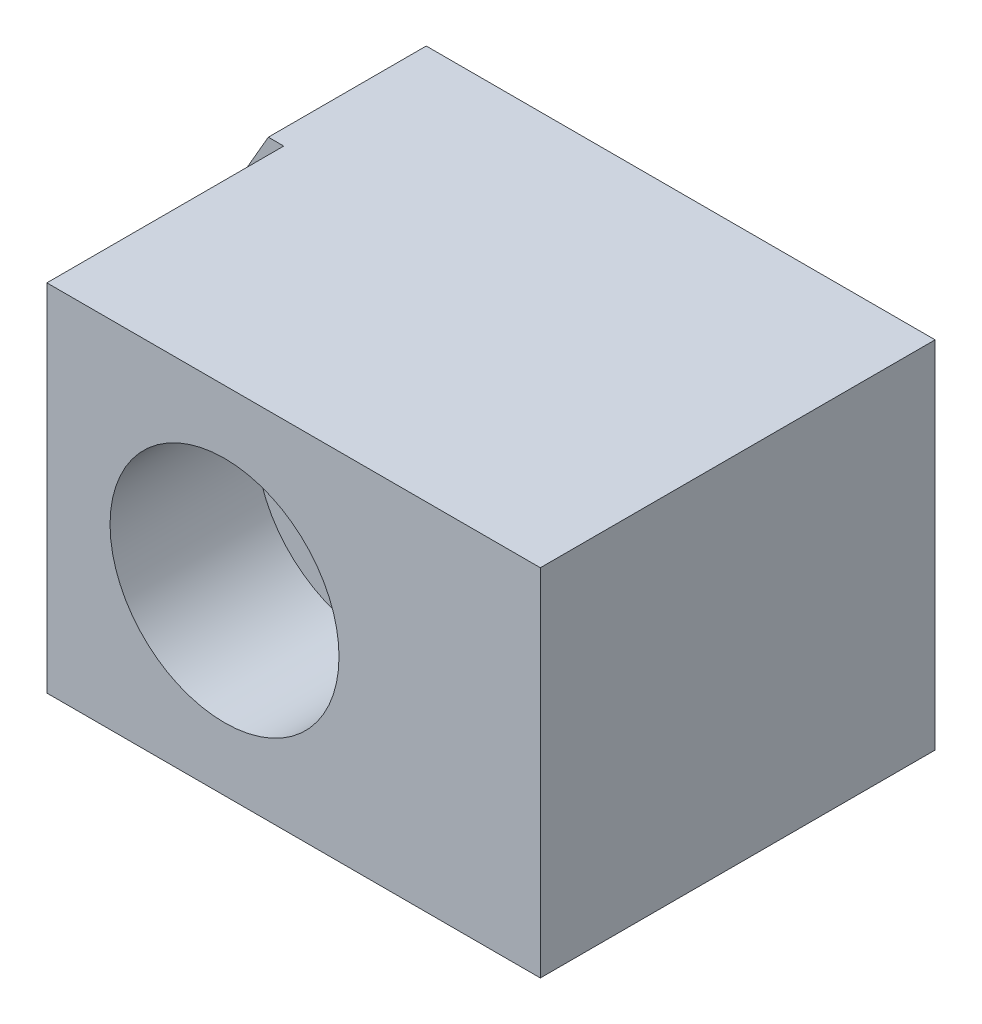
from build123d import *

# Parameters (mm, degrees)
BASE_EXTRUSION_DEPTH                               = 10
ENL_V_MAT_EXTRU_1_DEPTH                            = 6
CHAMBRAGE_POUR_VIS_T_TE_CYLINDRIQUE_FE_D           = 3.4
CHAMBRAGE_POUR_VIS_T_TE_CYLINDRIQUE_FE_CBORE_D     = 5.8
CHAMBRAGE_POUR_VIS_T_TE_CYLINDRIQUE_FE_CBORE_DEPTH = 3.7


with BuildPart() as part:
    # Esquisse1 → Base-Extrusion (new body)
    with BuildSketch(Plane.XY):
        Polygon((0, -4.5), (-12.890598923, -4.5), (-15.2, -0.5), (-15.2, 0.5), (-12.890598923, 4.5), (0, 4.5), align=None)
    extrude(amount=BASE_EXTRUSION_DEPTH)

    # Esquisse2 → Enl_v. mat.-Extru.1 (cut)
    with BuildSketch(Plane.XY.offset(10)):
        Polygon((-15.2, -0.5), (-12.5, -5.17653718), (-12.5, 5.17653718), (-15.2, 0.5), align=None)
    extrude(amount=-ENL_V_MAT_EXTRU_1_DEPTH, mode=Mode.SUBTRACT)

    # Chambrage pour vis _ t_te cylindrique fe (through all)
    with Locations(Plane.XY.offset(10)):
        with Locations((-8, 0)):
            CounterBoreHole(CHAMBRAGE_POUR_VIS_T_TE_CYLINDRIQUE_FE_D / 2, CHAMBRAGE_POUR_VIS_T_TE_CYLINDRIQUE_FE_CBORE_D / 2, CHAMBRAGE_POUR_VIS_T_TE_CYLINDRIQUE_FE_CBORE_DEPTH)


solid = part.part
